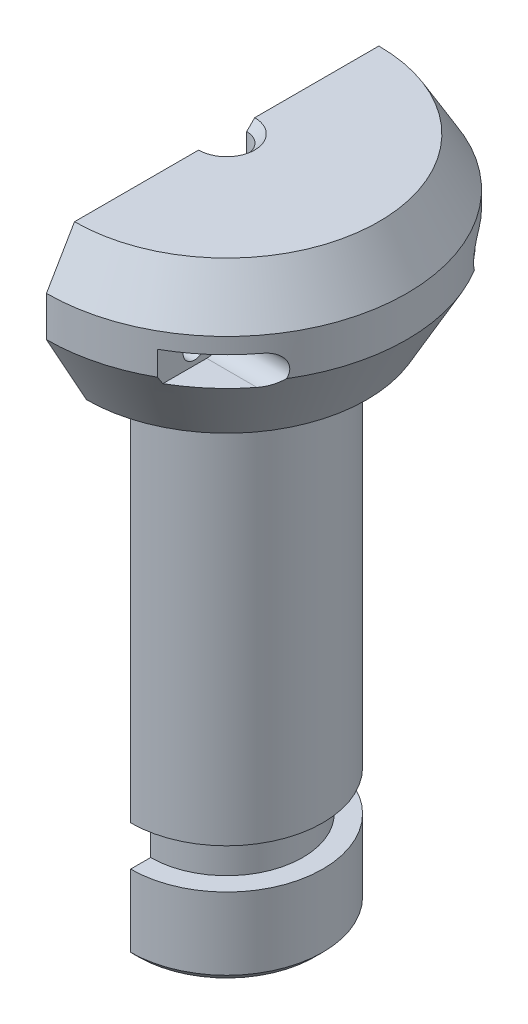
from build123d import *

# Parameters (mm, degrees)
ESQUISSE1_R                             = 45
ESQUISSE1_R_2                           = 5
BOSS_EXTRU_1_DEPTH                      = 40
ENL_V_MAT_EXTRU_1_DEPTH                 = 76.166481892
CHANFREIN1_SIZE                         = 12
CHANFREIN1_SIZE2                        = 7
CHANFREIN4_SIZE                         = 10
CHANFREIN4_SIZE2                        = 18
BOSS_EXTRU_2_START                      = 127
BOSS_EXTRU_2_DEPTH                      = 127
ENL_V_MAT_EXTRU_4_DEPTH                 = 18
CHANFREIN2_SIZE                         = 2
ESQUISSE6_R                             = 2.9
ENL_V_MAT_EXTRU_5_DEPTH                 = 137.685771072
ESQUISSE7_W                             = 5
ESQUISSE7_H                             = 10
ENL_VEMENT_DE_MATI_RE_R_VOLUTION1_ANGLE = 180
CHANFREIN3_SIZE                         = 2


with BuildPart() as part:
    # Esquisse1 → Boss.-Extru.1 (new body)
    with BuildSketch(Plane(origin=(0, 0, 0), x_dir=(1, 0, 0), z_dir=(0, 1, 0))):
        with Locations(Location((0, 0, 0), (0, 0, 270))):
            Circle(ESQUISSE1_R)
        with Locations(Location((0, 0, 0), (0, 0, 270))):
            Circle(ESQUISSE1_R_2, mode=Mode.SUBTRACT)
    extrude(amount=BOSS_EXTRU_1_DEPTH)

    # Esquisse2 → Enl_v. mat.-Extru.1 (cut, through all)
    with BuildSketch(Plane(origin=(0, 40, 0), x_dir=(-1, 0, 0), z_dir=(0, 1, 0))):
        with BuildLine():
            Line((0, -45), (0, 45))
            ThreePointArc((0, 45), (45, 0), (0, -45))
        make_face()
    extrude(amount=-ENL_V_MAT_EXTRU_1_DEPTH, mode=Mode.SUBTRACT)

    # Chanfrein1
    chanfrein1_edges = [part.edges().sort_by_distance(p)[0] for p in [
        (45, 40, 0),
    ]]
    chanfrein1_side = [part.faces().sort_by_distance(p)[0] for p in [
        (45, 20, 0),
    ]]
    chamfer(chanfrein1_edges, length=CHANFREIN1_SIZE, length2=CHANFREIN1_SIZE2, reference=chanfrein1_side[0])

    # Chanfrein4
    chanfrein4_edges = [part.edges().sort_by_distance(p)[0] for p in [
        (45, 0, 0),
    ]]
    chanfrein4_side = [part.faces().sort_by_distance(p)[0] for p in [
        (19.310799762, 0, 0),
    ]]
    chamfer(chanfrein4_edges, length=CHANFREIN4_SIZE, length2=CHANFREIN4_SIZE2, reference=chanfrein4_side[0])

    # Esquisse3 → Boss.-Extru.2 (add)
    with BuildSketch(Plane.XZ.offset(BOSS_EXTRU_2_START)):
        with BuildLine():
            Line((0, -5), (0, -24))
            ThreePointArc((0, -24), (24, 0), (0, 24))
            Line((0, 24), (0, 5))
            ThreePointArc((0, 5), (5, 0), (0, -5))
        make_face()
    extrude(amount=-BOSS_EXTRU_2_DEPTH)

    # Esquisse5 → Enl_v. mat.-Extru.4 (cut)
    with BuildSketch(Plane(origin=(40, 0, 0), x_dir=(0, 0, -1), z_dir=(1, 0, 0))):
        with BuildLine():
            Line((-27, 24.05), (-47, 24.05))
            Line((-47, 24.05), (-47, 15.95))
            Line((-47, 15.95), (-27, 15.95))
            ThreePointArc((-27, 15.95), (-22.95, 20), (-27, 24.05))
        make_face()
        with BuildLine():
            Line((27, 24.05), (47, 24.05))
            Line((47, 24.05), (47, 15.95))
            Line((47, 15.95), (27, 15.95))
            ThreePointArc((27, 15.95), (22.95, 20), (27, 24.05))
        make_face()
    extrude(amount=-ENL_V_MAT_EXTRU_4_DEPTH, mode=Mode.SUBTRACT)

    # Chanfrein2
    chanfrein2_edges = [part.edges().sort_by_distance(p)[0] for p in [
        (5, -127, 0),
        (5, 40, 0),
    ]]
    chamfer(chanfrein2_edges, length=CHANFREIN2_SIZE)

    # Esquisse6 → Enl_v. mat.-Extru.5 (cut, through all)
    with BuildSketch(Plane(origin=(22, 0, 0), x_dir=(0, 0, -1), z_dir=(1, 0, 0))):
        with Locations((-30, 20)):
            Circle(ESQUISSE6_R)
        with Locations((30, 20)):
            Circle(ESQUISSE6_R)
    extrude(amount=-ENL_V_MAT_EXTRU_5_DEPTH, mode=Mode.SUBTRACT)

    # Esquisse7 → Enl_vement de mati_re-R_volution1 (revolve, cut)
    with BuildSketch(Plane.ZY):
        with Locations((21.5, -102)):
            Rectangle(ESQUISSE7_W, ESQUISSE7_H)
    revolve(axis=Axis((0, 55.421739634, 0), (0, 1, 0)), revolution_arc=ENL_VEMENT_DE_MATI_RE_R_VOLUTION1_ANGLE, mode=Mode.SUBTRACT)

    # Chanfrein3
    chanfrein3_edges = [part.edges().sort_by_distance(p)[0] for p in [
        (24, -127, 0),
    ]]
    chamfer(chanfrein3_edges, length=CHANFREIN3_SIZE)


solid = part.part
